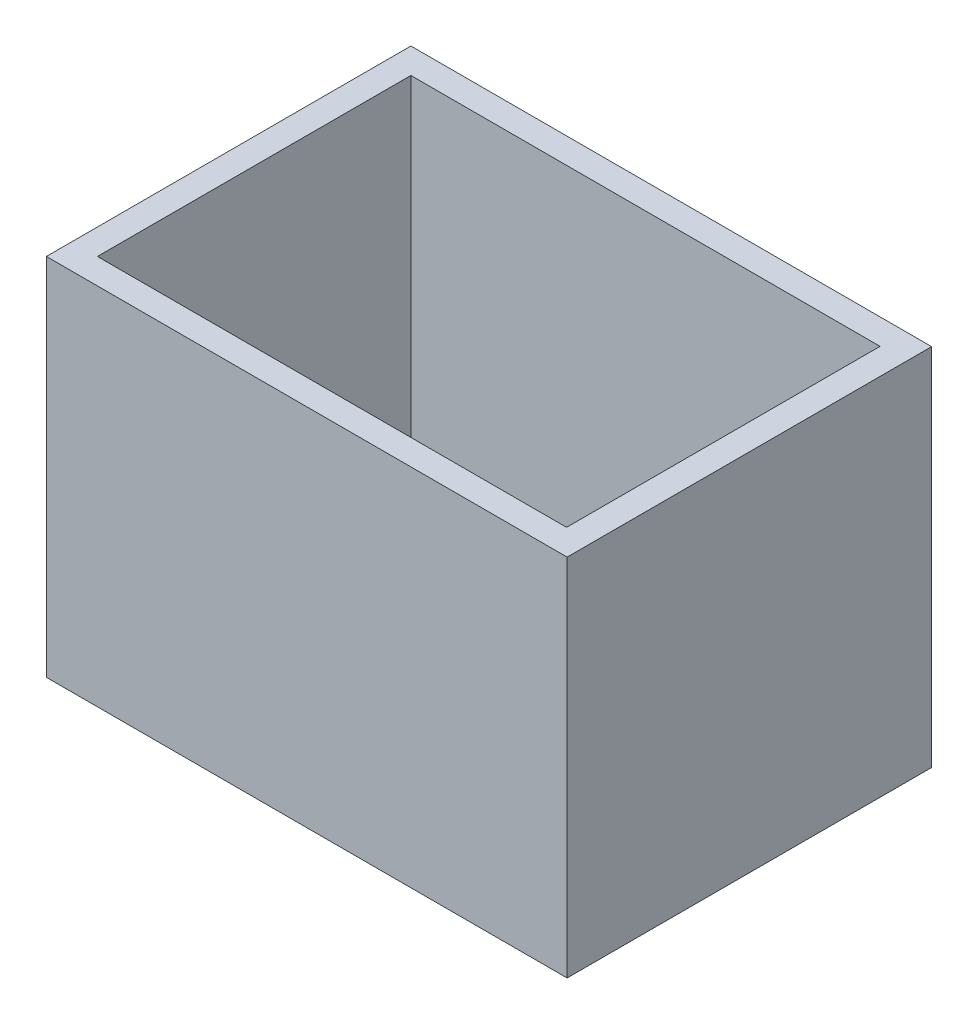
ISO-10303-21;
HEADER;
FILE_DESCRIPTION(('STEP AP214'),'2;1');
FILE_NAME('part.step','',(''),(''),'','','');
FILE_SCHEMA(('AUTOMOTIVE_DESIGN { 1 0 10303 214 1 1 1 1 }'));
ENDSEC;
DATA;
#1=APPLICATION_CONTEXT('core data for automotive mechanical design processes');
#2=APPLICATION_PROTOCOL_DEFINITION('international standard','automotive_design',2000,#1);
#3=PRODUCT_CONTEXT('',#1,'mechanical');
#4=PRODUCT('Part','Part','',(#3));
#5=PRODUCT_RELATED_PRODUCT_CATEGORY('part','',(#4));
#6=PRODUCT_DEFINITION_FORMATION('','',#4);
#7=PRODUCT_DEFINITION_CONTEXT('part definition',#1,'design');
#8=PRODUCT_DEFINITION('design','',#6,#7);
#9=PRODUCT_DEFINITION_SHAPE('','',#8);
#10=(LENGTH_UNIT() NAMED_UNIT(*) SI_UNIT(.MILLI.,.METRE.));
#11=(NAMED_UNIT(*) PLANE_ANGLE_UNIT() SI_UNIT($,.RADIAN.));
#12=(NAMED_UNIT(*) SI_UNIT($,.STERADIAN.) SOLID_ANGLE_UNIT());
#13=UNCERTAINTY_MEASURE_WITH_UNIT(LENGTH_MEASURE(1.E-05),#10,'distance_accuracy_value','');
#14=(GEOMETRIC_REPRESENTATION_CONTEXT(3) GLOBAL_UNCERTAINTY_ASSIGNED_CONTEXT((#13)) GLOBAL_UNIT_ASSIGNED_CONTEXT((#10,
#11,#12)) REPRESENTATION_CONTEXT('',''));
#15=CARTESIAN_POINT('',(0.,0.,0.));
#16=DIRECTION('',(0.,0.,1.));
#17=DIRECTION('',(1.,0.,0.));
#18=AXIS2_PLACEMENT_3D('',#15,#16,#17);
#19=CARTESIAN_POINT('',(-76.2962116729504,88.9,-34.5932753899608));
#20=DIRECTION('',(1.,0.,0.));
#21=DIRECTION('',(0.,0.,-1.));
#22=AXIS2_PLACEMENT_3D('',#19,#20,#21);
#23=PLANE('',#22);
#24=DIRECTION('',(0.,0.,1.));
#25=VECTOR('',#24,1.);
#26=CARTESIAN_POINT('',(-76.2962116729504,0.,-34.5932753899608));
#27=LINE('',#26,#25);
#28=CARTESIAN_POINT('',(-76.2962116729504,0.,-34.5932753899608));
#29=VERTEX_POINT('',#28);
#30=CARTESIAN_POINT('',(-76.2962116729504,0.,54.3067246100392));
#31=VERTEX_POINT('',#30);
#32=EDGE_CURVE('E134',#29,#31,#27,.T.);
#33=ORIENTED_EDGE('',*,*,#32,.T.);
#34=DIRECTION('',(0.,-1.,0.));
#35=VECTOR('',#34,1.);
#36=CARTESIAN_POINT('',(-76.2962116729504,88.9,54.3067246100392));
#37=LINE('',#36,#35);
#38=CARTESIAN_POINT('',(-76.2962116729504,88.9,54.3067246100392));
#39=VERTEX_POINT('',#38);
#40=EDGE_CURVE('E11',#39,#31,#37,.T.);
#41=ORIENTED_EDGE('',*,*,#40,.F.);
#42=DIRECTION('',(0.,0.,1.));
#43=VECTOR('',#42,1.);
#44=CARTESIAN_POINT('',(-76.2962116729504,88.9,-34.5932753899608));
#45=LINE('',#44,#43);
#46=CARTESIAN_POINT('',(-76.2962116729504,88.9,-34.5932753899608));
#47=VERTEX_POINT('',#46);
#48=EDGE_CURVE('E138',#47,#39,#45,.T.);
#49=ORIENTED_EDGE('',*,*,#48,.F.);
#50=DIRECTION('',(0.,-1.,0.));
#51=VECTOR('',#50,1.);
#52=CARTESIAN_POINT('',(-76.2962116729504,88.9,-34.5932753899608));
#53=LINE('',#52,#51);
#54=EDGE_CURVE('E148',#47,#29,#53,.T.);
#55=ORIENTED_EDGE('',*,*,#54,.T.);
#56=EDGE_LOOP('',(#33,#41,#49,#55));
#57=FACE_BOUND('',#56,.T.);
#58=ADVANCED_FACE('F37',(#57),#23,.F.);
#59=CARTESIAN_POINT('',(-76.2962116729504,88.9,54.3067246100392));
#60=DIRECTION('',(0.,0.,-1.));
#61=DIRECTION('',(-1.,0.,0.));
#62=AXIS2_PLACEMENT_3D('',#59,#60,#61);
#63=PLANE('',#62);
#64=DIRECTION('',(1.,0.,0.));
#65=VECTOR('',#64,1.);
#66=CARTESIAN_POINT('',(-76.2962116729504,0.,54.3067246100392));
#67=LINE('',#66,#65);
#68=CARTESIAN_POINT('',(50.7037883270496,0.,54.3067246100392));
#69=VERTEX_POINT('',#68);
#70=EDGE_CURVE('E151',#31,#69,#67,.T.);
#71=ORIENTED_EDGE('',*,*,#70,.T.);
#72=DIRECTION('',(0.,-1.,0.));
#73=VECTOR('',#72,1.);
#74=CARTESIAN_POINT('',(50.7037883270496,88.9,54.3067246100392));
#75=LINE('',#74,#73);
#76=CARTESIAN_POINT('',(50.7037883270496,88.9,54.3067246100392));
#77=VERTEX_POINT('',#76);
#78=EDGE_CURVE('E44',#77,#69,#75,.T.);
#79=ORIENTED_EDGE('',*,*,#78,.F.);
#80=DIRECTION('',(1.,0.,0.));
#81=VECTOR('',#80,1.);
#82=CARTESIAN_POINT('',(-76.2962116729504,88.9,54.3067246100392));
#83=LINE('',#82,#81);
#84=EDGE_CURVE('E141',#39,#77,#83,.T.);
#85=ORIENTED_EDGE('',*,*,#84,.F.);
#86=ORIENTED_EDGE('',*,*,#40,.T.);
#87=EDGE_LOOP('',(#71,#79,#85,#86));
#88=FACE_BOUND('',#87,.T.);
#89=ADVANCED_FACE('F179',(#88),#63,.F.);
#90=CARTESIAN_POINT('',(50.7037883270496,88.9,-34.5932753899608));
#91=DIRECTION('',(-1.,0.,0.));
#92=DIRECTION('',(0.,0.,1.));
#93=AXIS2_PLACEMENT_3D('',#90,#91,#92);
#94=PLANE('',#93);
#95=DIRECTION('',(0.,0.,-1.));
#96=VECTOR('',#95,1.);
#97=CARTESIAN_POINT('',(50.7037883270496,0.,-34.5932753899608));
#98=LINE('',#97,#96);
#99=CARTESIAN_POINT('',(50.7037883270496,0.,-34.5932753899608));
#100=VERTEX_POINT('',#99);
#101=EDGE_CURVE('E153',#69,#100,#98,.T.);
#102=ORIENTED_EDGE('',*,*,#101,.T.);
#103=DIRECTION('',(0.,-1.,0.));
#104=VECTOR('',#103,1.);
#105=CARTESIAN_POINT('',(50.7037883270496,88.9,-34.5932753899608));
#106=LINE('',#105,#104);
#107=CARTESIAN_POINT('',(50.7037883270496,88.9,-34.5932753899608));
#108=VERTEX_POINT('',#107);
#109=EDGE_CURVE('E158',#108,#100,#106,.T.);
#110=ORIENTED_EDGE('',*,*,#109,.F.);
#111=DIRECTION('',(0.,0.,-1.));
#112=VECTOR('',#111,1.);
#113=CARTESIAN_POINT('',(50.7037883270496,88.9,-34.5932753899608));
#114=LINE('',#113,#112);
#115=EDGE_CURVE('E144',#77,#108,#114,.T.);
#116=ORIENTED_EDGE('',*,*,#115,.F.);
#117=ORIENTED_EDGE('',*,*,#78,.T.);
#118=EDGE_LOOP('',(#102,#110,#116,#117));
#119=FACE_BOUND('',#118,.T.);
#120=ADVANCED_FACE('F165',(#119),#94,.F.);
#121=CARTESIAN_POINT('',(-76.2962116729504,88.9,-34.5932753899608));
#122=DIRECTION('',(0.,0.,1.));
#123=DIRECTION('',(1.,0.,0.));
#124=AXIS2_PLACEMENT_3D('',#121,#122,#123);
#125=PLANE('',#124);
#126=DIRECTION('',(-1.,0.,0.));
#127=VECTOR('',#126,1.);
#128=CARTESIAN_POINT('',(-76.2962116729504,0.,-34.5932753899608));
#129=LINE('',#128,#127);
#130=EDGE_CURVE('E142',#100,#29,#129,.T.);
#131=ORIENTED_EDGE('',*,*,#130,.T.);
#132=ORIENTED_EDGE('',*,*,#54,.F.);
#133=DIRECTION('',(-1.,0.,0.));
#134=VECTOR('',#133,1.);
#135=CARTESIAN_POINT('',(-76.2962116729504,88.9,-34.5932753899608));
#136=LINE('',#135,#134);
#137=EDGE_CURVE('E146',#108,#47,#136,.T.);
#138=ORIENTED_EDGE('',*,*,#137,.F.);
#139=ORIENTED_EDGE('',*,*,#109,.T.);
#140=EDGE_LOOP('',(#131,#132,#138,#139));
#141=FACE_BOUND('',#140,.T.);
#142=ADVANCED_FACE('F172',(#141),#125,.F.);
#143=CARTESIAN_POINT('',(0.,88.9,0.));
#144=DIRECTION('',(0.,1.,0.));
#145=DIRECTION('',(0.,0.,1.));
#146=AXIS2_PLACEMENT_3D('',#143,#144,#145);
#147=PLANE('',#146);
#148=DIRECTION('',(0.,0.,1.));
#149=VECTOR('',#148,1.);
#150=CARTESIAN_POINT('',(-70.0732116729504,88.9,-28.3702753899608));
#151=LINE('',#150,#149);
#152=CARTESIAN_POINT('',(-70.0732116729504,88.9,-28.3702753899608));
#153=VERTEX_POINT('',#152);
#154=CARTESIAN_POINT('',(-70.0732116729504,88.9,48.0837246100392));
#155=VERTEX_POINT('',#154);
#156=EDGE_CURVE('E51',#153,#155,#151,.T.);
#157=ORIENTED_EDGE('',*,*,#156,.F.);
#158=DIRECTION('',(-1.,0.,0.));
#159=VECTOR('',#158,1.);
#160=CARTESIAN_POINT('',(-70.0732116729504,88.9,-28.3702753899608));
#161=LINE('',#160,#159);
#162=CARTESIAN_POINT('',(44.3537883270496,88.9,-28.3702753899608));
#163=VERTEX_POINT('',#162);
#164=EDGE_CURVE('E119',#163,#153,#161,.T.);
#165=ORIENTED_EDGE('',*,*,#164,.F.);
#166=DIRECTION('',(0.,0.,-1.));
#167=VECTOR('',#166,1.);
#168=CARTESIAN_POINT('',(44.3537883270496,88.9,-28.3702753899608));
#169=LINE('',#168,#167);
#170=CARTESIAN_POINT('',(44.3537883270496,88.9,48.0837246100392));
#171=VERTEX_POINT('',#170);
#172=EDGE_CURVE('E122',#171,#163,#169,.T.);
#173=ORIENTED_EDGE('',*,*,#172,.F.);
#174=DIRECTION('',(1.,0.,0.));
#175=VECTOR('',#174,1.);
#176=CARTESIAN_POINT('',(-70.0732116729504,88.9,48.0837246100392));
#177=LINE('',#176,#175);
#178=EDGE_CURVE('E128',#155,#171,#177,.T.);
#179=ORIENTED_EDGE('',*,*,#178,.F.);
#180=EDGE_LOOP('',(#157,#165,#173,#179));
#181=FACE_BOUND('',#180,.T.);
#182=ORIENTED_EDGE('',*,*,#48,.T.);
#183=ORIENTED_EDGE('',*,*,#84,.T.);
#184=ORIENTED_EDGE('',*,*,#115,.T.);
#185=ORIENTED_EDGE('',*,*,#137,.T.);
#186=EDGE_LOOP('',(#182,#183,#184,#185));
#187=FACE_BOUND('',#186,.T.);
#188=ADVANCED_FACE('F178',(#181,#187),#147,.T.);
#189=CARTESIAN_POINT('',(0.,0.,0.));
#190=DIRECTION('',(0.,1.,0.));
#191=DIRECTION('',(0.,0.,1.));
#192=AXIS2_PLACEMENT_3D('',#189,#190,#191);
#193=PLANE('',#192);
#194=DIRECTION('',(-1.,0.,0.));
#195=VECTOR('',#194,1.);
#196=CARTESIAN_POINT('',(-70.0732116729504,0.,-28.3702753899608));
#197=LINE('',#196,#195);
#198=CARTESIAN_POINT('',(44.3537883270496,0.,-28.3702753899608));
#199=VERTEX_POINT('',#198);
#200=CARTESIAN_POINT('',(-70.0732116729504,0.,-28.3702753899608));
#201=VERTEX_POINT('',#200);
#202=EDGE_CURVE('E109',#199,#201,#197,.T.);
#203=ORIENTED_EDGE('',*,*,#202,.T.);
#204=DIRECTION('',(0.,0.,1.));
#205=VECTOR('',#204,1.);
#206=CARTESIAN_POINT('',(-70.0732116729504,0.,-28.3702753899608));
#207=LINE('',#206,#205);
#208=CARTESIAN_POINT('',(-70.0732116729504,0.,48.0837246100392));
#209=VERTEX_POINT('',#208);
#210=EDGE_CURVE('E103',#201,#209,#207,.T.);
#211=ORIENTED_EDGE('',*,*,#210,.T.);
#212=DIRECTION('',(1.,0.,0.));
#213=VECTOR('',#212,1.);
#214=CARTESIAN_POINT('',(-70.0732116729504,0.,48.0837246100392));
#215=LINE('',#214,#213);
#216=CARTESIAN_POINT('',(44.3537883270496,0.,48.0837246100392));
#217=VERTEX_POINT('',#216);
#218=EDGE_CURVE('E112',#209,#217,#215,.T.);
#219=ORIENTED_EDGE('',*,*,#218,.T.);
#220=DIRECTION('',(0.,0.,-1.));
#221=VECTOR('',#220,1.);
#222=CARTESIAN_POINT('',(44.3537883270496,0.,-28.3702753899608));
#223=LINE('',#222,#221);
#224=EDGE_CURVE('E59',#217,#199,#223,.T.);
#225=ORIENTED_EDGE('',*,*,#224,.T.);
#226=EDGE_LOOP('',(#203,#211,#219,#225));
#227=FACE_BOUND('',#226,.T.);
#228=ORIENTED_EDGE('',*,*,#32,.F.);
#229=ORIENTED_EDGE('',*,*,#130,.F.);
#230=ORIENTED_EDGE('',*,*,#101,.F.);
#231=ORIENTED_EDGE('',*,*,#70,.F.);
#232=EDGE_LOOP('',(#228,#229,#230,#231));
#233=FACE_BOUND('',#232,.T.);
#234=ADVANCED_FACE('F116',(#227,#233),#193,.F.);
#235=CARTESIAN_POINT('',(-70.0732116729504,0.,-28.3702753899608));
#236=DIRECTION('',(-1.,0.,0.));
#237=DIRECTION('',(0.,0.,1.));
#238=AXIS2_PLACEMENT_3D('',#235,#236,#237);
#239=PLANE('',#238);
#240=ORIENTED_EDGE('',*,*,#156,.T.);
#241=DIRECTION('',(0.,1.,0.));
#242=VECTOR('',#241,1.);
#243=CARTESIAN_POINT('',(-70.0732116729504,0.,48.0837246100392));
#244=LINE('',#243,#242);
#245=EDGE_CURVE('E99',#209,#155,#244,.T.);
#246=ORIENTED_EDGE('',*,*,#245,.F.);
#247=ORIENTED_EDGE('',*,*,#210,.F.);
#248=DIRECTION('',(0.,1.,0.));
#249=VECTOR('',#248,1.);
#250=CARTESIAN_POINT('',(-70.0732116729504,0.,-28.3702753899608));
#251=LINE('',#250,#249);
#252=EDGE_CURVE('E132',#201,#153,#251,.T.);
#253=ORIENTED_EDGE('',*,*,#252,.T.);
#254=EDGE_LOOP('',(#240,#246,#247,#253));
#255=FACE_BOUND('',#254,.T.);
#256=ADVANCED_FACE('F101',(#255),#239,.F.);
#257=CARTESIAN_POINT('',(-70.0732116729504,0.,-28.3702753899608));
#258=DIRECTION('',(0.,0.,-1.));
#259=DIRECTION('',(-1.,0.,0.));
#260=AXIS2_PLACEMENT_3D('',#257,#258,#259);
#261=PLANE('',#260);
#262=ORIENTED_EDGE('',*,*,#164,.T.);
#263=ORIENTED_EDGE('',*,*,#252,.F.);
#264=ORIENTED_EDGE('',*,*,#202,.F.);
#265=DIRECTION('',(0.,1.,0.));
#266=VECTOR('',#265,1.);
#267=CARTESIAN_POINT('',(44.3537883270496,0.,-28.3702753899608));
#268=LINE('',#267,#266);
#269=EDGE_CURVE('E135',#199,#163,#268,.T.);
#270=ORIENTED_EDGE('',*,*,#269,.T.);
#271=EDGE_LOOP('',(#262,#263,#264,#270));
#272=FACE_BOUND('',#271,.T.);
#273=ADVANCED_FACE('F196',(#272),#261,.F.);
#274=CARTESIAN_POINT('',(44.3537883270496,0.,-28.3702753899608));
#275=DIRECTION('',(1.,0.,0.));
#276=DIRECTION('',(0.,0.,-1.));
#277=AXIS2_PLACEMENT_3D('',#274,#275,#276);
#278=PLANE('',#277);
#279=ORIENTED_EDGE('',*,*,#172,.T.);
#280=ORIENTED_EDGE('',*,*,#269,.F.);
#281=ORIENTED_EDGE('',*,*,#224,.F.);
#282=DIRECTION('',(0.,1.,0.));
#283=VECTOR('',#282,1.);
#284=CARTESIAN_POINT('',(44.3537883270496,0.,48.0837246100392));
#285=LINE('',#284,#283);
#286=EDGE_CURVE('E108',#217,#171,#285,.T.);
#287=ORIENTED_EDGE('',*,*,#286,.T.);
#288=EDGE_LOOP('',(#279,#280,#281,#287));
#289=FACE_BOUND('',#288,.T.);
#290=ADVANCED_FACE('F199',(#289),#278,.F.);
#291=CARTESIAN_POINT('',(-70.0732116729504,0.,48.0837246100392));
#292=DIRECTION('',(0.,0.,1.));
#293=DIRECTION('',(1.,0.,0.));
#294=AXIS2_PLACEMENT_3D('',#291,#292,#293);
#295=PLANE('',#294);
#296=ORIENTED_EDGE('',*,*,#178,.T.);
#297=ORIENTED_EDGE('',*,*,#286,.F.);
#298=ORIENTED_EDGE('',*,*,#218,.F.);
#299=ORIENTED_EDGE('',*,*,#245,.T.);
#300=EDGE_LOOP('',(#296,#297,#298,#299));
#301=FACE_BOUND('',#300,.T.);
#302=ADVANCED_FACE('F113',(#301),#295,.F.);
#303=CLOSED_SHELL('',(#58,#89,#120,#142,#188,#234,#256,#273,#290,#302));
#304=MANIFOLD_SOLID_BREP('B2',#303);
#305=ADVANCED_BREP_SHAPE_REPRESENTATION('',(#18,#304),#14);
#306=SHAPE_DEFINITION_REPRESENTATION(#9,#305);
ENDSEC;
END-ISO-10303-21;
